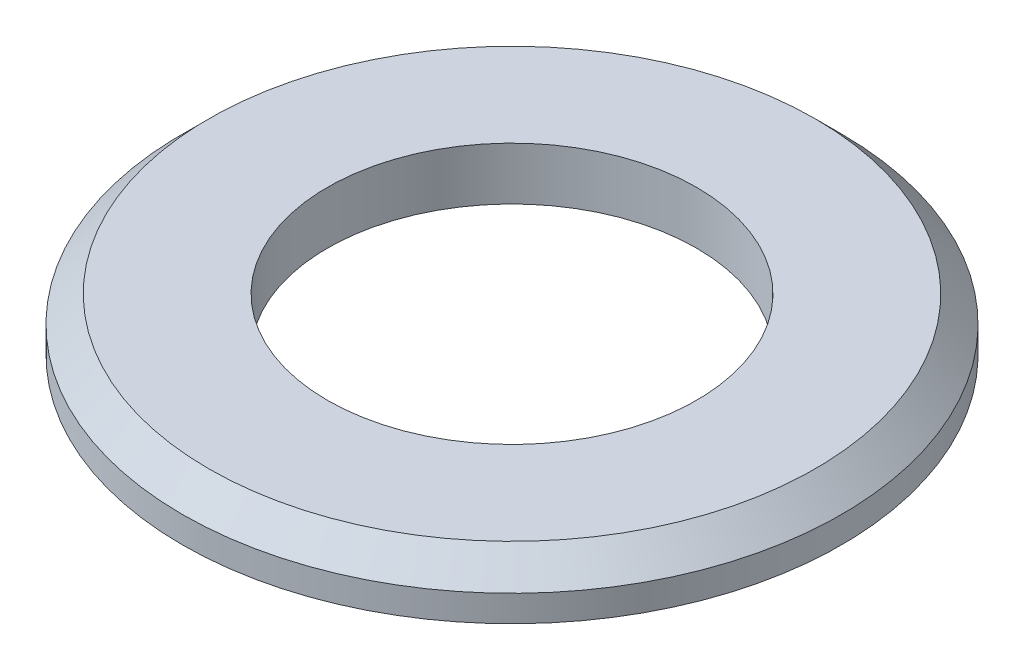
ISO-10303-21;
HEADER;
FILE_DESCRIPTION(('STEP AP214'),'2;1');
FILE_NAME('part.step','',(''),(''),'','','');
FILE_SCHEMA(('AUTOMOTIVE_DESIGN { 1 0 10303 214 1 1 1 1 }'));
ENDSEC;
DATA;
#1=APPLICATION_CONTEXT('core data for automotive mechanical design processes');
#2=APPLICATION_PROTOCOL_DEFINITION('international standard','automotive_design',2000,#1);
#3=PRODUCT_CONTEXT('',#1,'mechanical');
#4=PRODUCT('Part','Part','',(#3));
#5=PRODUCT_RELATED_PRODUCT_CATEGORY('part','',(#4));
#6=PRODUCT_DEFINITION_FORMATION('','',#4);
#7=PRODUCT_DEFINITION_CONTEXT('part definition',#1,'design');
#8=PRODUCT_DEFINITION('design','',#6,#7);
#9=PRODUCT_DEFINITION_SHAPE('','',#8);
#10=(LENGTH_UNIT() NAMED_UNIT(*) SI_UNIT(.MILLI.,.METRE.));
#11=(NAMED_UNIT(*) PLANE_ANGLE_UNIT() SI_UNIT($,.RADIAN.));
#12=(NAMED_UNIT(*) SI_UNIT($,.STERADIAN.) SOLID_ANGLE_UNIT());
#13=UNCERTAINTY_MEASURE_WITH_UNIT(LENGTH_MEASURE(1.E-05),#10,'distance_accuracy_value','');
#14=(GEOMETRIC_REPRESENTATION_CONTEXT(3) GLOBAL_UNCERTAINTY_ASSIGNED_CONTEXT((#13)) GLOBAL_UNIT_ASSIGNED_CONTEXT((#10,
#11,#12)) REPRESENTATION_CONTEXT('',''));
#15=CARTESIAN_POINT('',(0.,0.,0.));
#16=DIRECTION('',(0.,0.,1.));
#17=DIRECTION('',(1.,0.,0.));
#18=AXIS2_PLACEMENT_3D('',#15,#16,#17);
#19=CARTESIAN_POINT('',(0.,4.,0.));
#20=DIRECTION('',(0.,1.,0.));
#21=DIRECTION('',(0.,0.,1.));
#22=AXIS2_PLACEMENT_3D('',#19,#20,#21);
#23=PLANE('',#22);
#24=CARTESIAN_POINT('',(0.,4.,0.));
#25=DIRECTION('',(0.,1.,0.));
#26=DIRECTION('',(0.,0.,1.));
#27=AXIS2_PLACEMENT_3D('',#24,#25,#26);
#28=CIRCLE('',#27,23.);
#29=CARTESIAN_POINT('',(0.,4.,23.));
#30=VERTEX_POINT('',#29);
#31=EDGE_CURVE('E35',#30,#30,#28,.T.);
#32=ORIENTED_EDGE('',*,*,#31,.T.);
#33=EDGE_LOOP('',(#32));
#34=FACE_BOUND('',#33,.T.);
#35=CARTESIAN_POINT('',(0.,4.,0.));
#36=DIRECTION('',(0.,1.,0.));
#37=DIRECTION('',(0.,0.,1.));
#38=AXIS2_PLACEMENT_3D('',#35,#36,#37);
#39=CIRCLE('',#38,14.);
#40=CARTESIAN_POINT('',(0.,4.,14.));
#41=VERTEX_POINT('',#40);
#42=EDGE_CURVE('E43',#41,#41,#39,.T.);
#43=ORIENTED_EDGE('',*,*,#42,.F.);
#44=EDGE_LOOP('',(#43));
#45=FACE_BOUND('',#44,.T.);
#46=ADVANCED_FACE('F28',(#34,#45),#23,.T.);
#47=CARTESIAN_POINT('',(0.,0.,0.));
#48=DIRECTION('',(0.,1.,0.));
#49=DIRECTION('',(0.,0.,1.));
#50=AXIS2_PLACEMENT_3D('',#47,#48,#49);
#51=PLANE('',#50);
#52=CARTESIAN_POINT('',(0.,0.,0.));
#53=DIRECTION('',(0.,1.,0.));
#54=DIRECTION('',(0.,0.,1.));
#55=AXIS2_PLACEMENT_3D('',#52,#53,#54);
#56=CIRCLE('',#55,25.);
#57=CARTESIAN_POINT('',(0.,0.,25.));
#58=VERTEX_POINT('',#57);
#59=EDGE_CURVE('E39',#58,#58,#56,.T.);
#60=ORIENTED_EDGE('',*,*,#59,.F.);
#61=EDGE_LOOP('',(#60));
#62=FACE_BOUND('',#61,.T.);
#63=CARTESIAN_POINT('',(0.,0.,0.));
#64=DIRECTION('',(0.,1.,0.));
#65=DIRECTION('',(0.,0.,1.));
#66=AXIS2_PLACEMENT_3D('',#63,#64,#65);
#67=CIRCLE('',#66,14.);
#68=CARTESIAN_POINT('',(0.,0.,14.));
#69=VERTEX_POINT('',#68);
#70=EDGE_CURVE('E48',#69,#69,#67,.T.);
#71=ORIENTED_EDGE('',*,*,#70,.T.);
#72=EDGE_LOOP('',(#71));
#73=FACE_BOUND('',#72,.T.);
#74=ADVANCED_FACE('F52',(#62,#73),#51,.F.);
#75=CARTESIAN_POINT('',(0.,4.,0.));
#76=DIRECTION('',(0.,-1.,0.));
#77=DIRECTION('',(0.,0.,-1.));
#78=AXIS2_PLACEMENT_3D('',#75,#76,#77);
#79=CYLINDRICAL_SURFACE('',#78,25.);
#80=CARTESIAN_POINT('',(0.,2.00000000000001,0.));
#81=DIRECTION('',(0.,1.,0.));
#82=DIRECTION('',(0.,0.,1.));
#83=AXIS2_PLACEMENT_3D('',#80,#81,#82);
#84=CIRCLE('',#83,25.);
#85=CARTESIAN_POINT('',(0.,2.00000000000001,25.));
#86=VERTEX_POINT('',#85);
#87=EDGE_CURVE('E10',#86,#86,#84,.F.);
#88=ORIENTED_EDGE('',*,*,#87,.T.);
#89=EDGE_LOOP('',(#88));
#90=FACE_BOUND('',#89,.T.);
#91=ORIENTED_EDGE('',*,*,#59,.T.);
#92=EDGE_LOOP('',(#91));
#93=FACE_BOUND('',#92,.T.);
#94=ADVANCED_FACE('F30',(#90,#93),#79,.T.);
#95=CARTESIAN_POINT('',(0.,4.,0.));
#96=DIRECTION('',(0.,-1.,0.));
#97=DIRECTION('',(0.,0.,-1.));
#98=AXIS2_PLACEMENT_3D('',#95,#96,#97);
#99=CYLINDRICAL_SURFACE('',#98,14.);
#100=ORIENTED_EDGE('',*,*,#42,.T.);
#101=EDGE_LOOP('',(#100));
#102=FACE_BOUND('',#101,.T.);
#103=ORIENTED_EDGE('',*,*,#70,.F.);
#104=EDGE_LOOP('',(#103));
#105=FACE_BOUND('',#104,.T.);
#106=ADVANCED_FACE('F54',(#102,#105),#99,.F.);
#107=CARTESIAN_POINT('',(0.,4.,0.));
#108=DIRECTION('',(0.,-1.,0.));
#109=DIRECTION('',(0.,0.,-1.));
#110=AXIS2_PLACEMENT_3D('',#107,#108,#109);
#111=CONICAL_SURFACE('',#110,23.,0.785398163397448);
#112=ORIENTED_EDGE('',*,*,#87,.F.);
#113=EDGE_LOOP('',(#112));
#114=FACE_BOUND('',#113,.T.);
#115=ORIENTED_EDGE('',*,*,#31,.F.);
#116=EDGE_LOOP('',(#115));
#117=FACE_BOUND('',#116,.T.);
#118=ADVANCED_FACE('F56',(#114,#117),#111,.T.);
#119=CLOSED_SHELL('',(#46,#74,#94,#106,#118));
#120=MANIFOLD_SOLID_BREP('B2',#119);
#121=ADVANCED_BREP_SHAPE_REPRESENTATION('',(#18,#120),#14);
#122=SHAPE_DEFINITION_REPRESENTATION(#9,#121);
ENDSEC;
END-ISO-10303-21;
